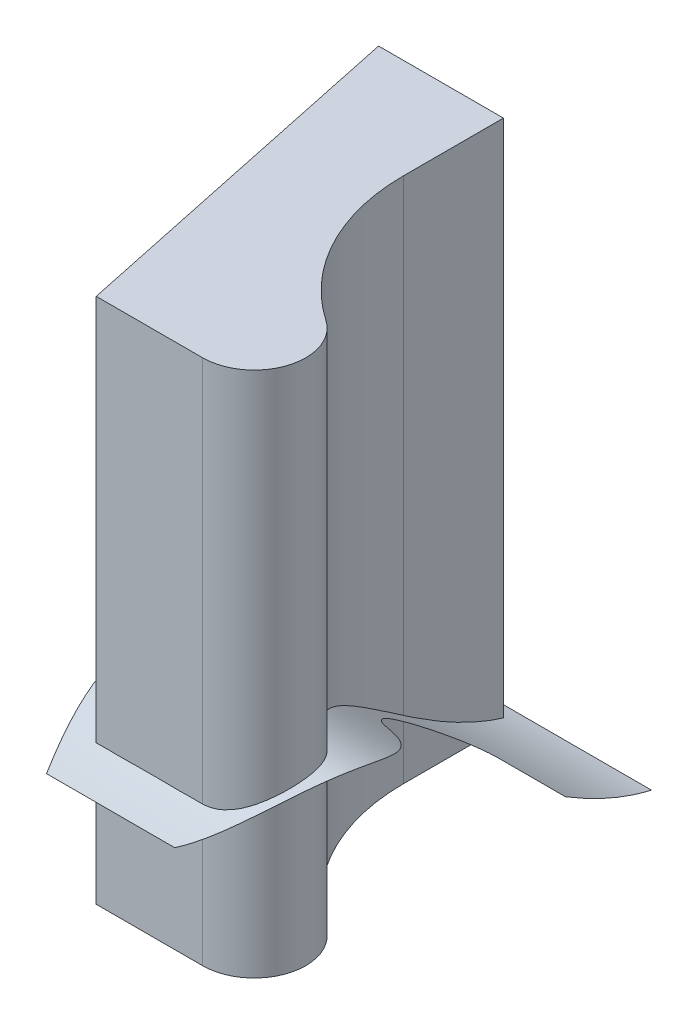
from build123d import *

# Parameters (mm, degrees)
BOSS_EXTRUDE2_DEPTH = 101.6


with BuildPart() as part:
    # Sketch3 → Boss-Extrude2 (new body)
    with BuildSketch(Plane(origin=(0, 0, 0), x_dir=(1, 0, 0), z_dir=(0, 1, 0))):
        with BuildLine():
            Line((-17.406662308, 39.37934926), (-2.813174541, -29.696492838))
            Line((-2.813174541, -29.696492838), (17.725808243, -29.696492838))
            ThreePointArc((17.725808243, -29.696492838), (27.231226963, -22.688306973), (23.347003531, -11.535708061))
            ThreePointArc((23.347003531, -11.535708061), (11.107839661, 2.200172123), (6.687993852, 20.058965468))
            Line((6.687993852, 20.058965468), (6.687993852, 39.37934926))
            Line((6.687993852, 39.37934926), (-17.406662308, 39.37934926))
        make_face()
    extrude(amount=BOSS_EXTRUDE2_DEPTH)


solid = part.part
